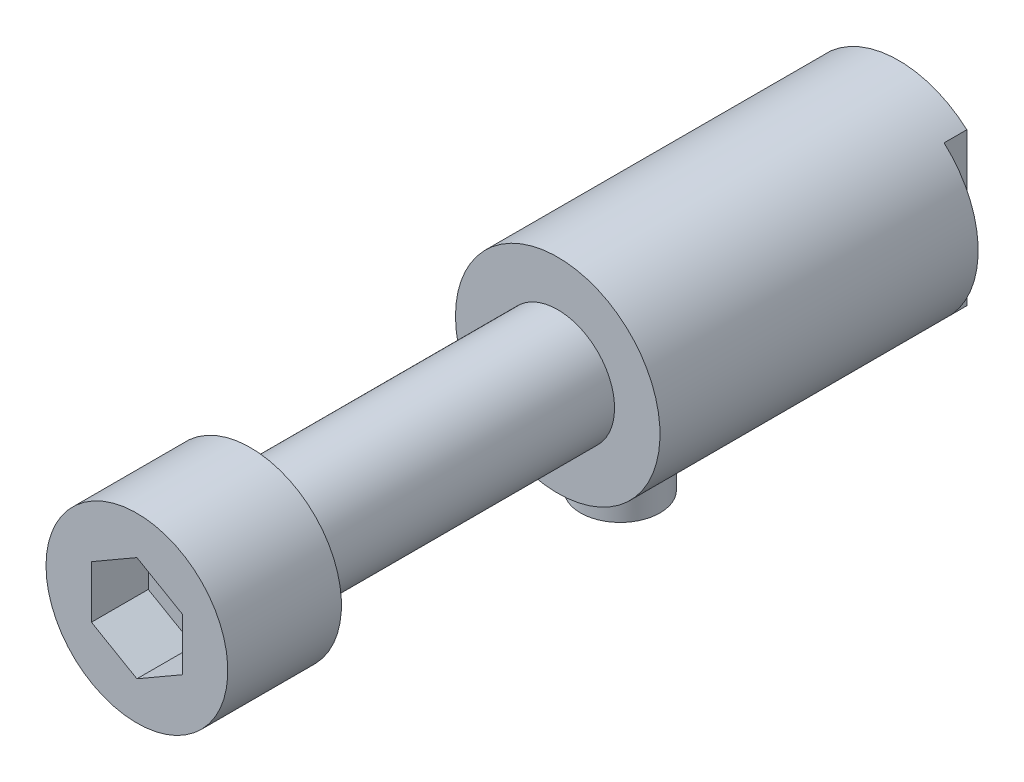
ISO-10303-21;
HEADER;
FILE_DESCRIPTION(('STEP AP214'),'2;1');
FILE_NAME('part.step','',(''),(''),'','','');
FILE_SCHEMA(('AUTOMOTIVE_DESIGN { 1 0 10303 214 1 1 1 1 }'));
ENDSEC;
DATA;
#1=APPLICATION_CONTEXT('core data for automotive mechanical design processes');
#2=APPLICATION_PROTOCOL_DEFINITION('international standard','automotive_design',2000,#1);
#3=PRODUCT_CONTEXT('',#1,'mechanical');
#4=PRODUCT('Part','Part','',(#3));
#5=PRODUCT_RELATED_PRODUCT_CATEGORY('part','',(#4));
#6=PRODUCT_DEFINITION_FORMATION('','',#4);
#7=PRODUCT_DEFINITION_CONTEXT('part definition',#1,'design');
#8=PRODUCT_DEFINITION('design','',#6,#7);
#9=PRODUCT_DEFINITION_SHAPE('','',#8);
#10=(LENGTH_UNIT() NAMED_UNIT(*) SI_UNIT(.MILLI.,.METRE.));
#11=(NAMED_UNIT(*) PLANE_ANGLE_UNIT() SI_UNIT($,.RADIAN.));
#12=(NAMED_UNIT(*) SI_UNIT($,.STERADIAN.) SOLID_ANGLE_UNIT());
#13=UNCERTAINTY_MEASURE_WITH_UNIT(LENGTH_MEASURE(1.E-05),#10,'distance_accuracy_value','');
#14=(GEOMETRIC_REPRESENTATION_CONTEXT(3) GLOBAL_UNCERTAINTY_ASSIGNED_CONTEXT((#13)) GLOBAL_UNIT_ASSIGNED_CONTEXT((#10,
#11,#12)) REPRESENTATION_CONTEXT('',''));
#15=CARTESIAN_POINT('',(0.,0.,0.));
#16=DIRECTION('',(0.,0.,1.));
#17=DIRECTION('',(1.,0.,0.));
#18=AXIS2_PLACEMENT_3D('',#15,#16,#17);
#19=CARTESIAN_POINT('',(0.,0.,0.));
#20=DIRECTION('',(0.,0.,1.));
#21=DIRECTION('',(1.,0.,0.));
#22=AXIS2_PLACEMENT_3D('',#19,#20,#21);
#23=CYLINDRICAL_SURFACE('',#22,9.);
#24=CARTESIAN_POINT('',(0.,-9.,28.));
#25=CARTESIAN_POINT('',(-0.0944966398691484,-9.00000002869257,27.999999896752));
#26=CARTESIAN_POINT('',(-0.188987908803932,-8.9985070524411,27.9961676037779));
#27=CARTESIAN_POINT('',(-0.377269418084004,-8.99258387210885,27.9808914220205));
#28=CARTESIAN_POINT('',(-0.471059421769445,-8.9881527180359,27.9694450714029));
#29=CARTESIAN_POINT('',(-0.750206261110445,-8.97060600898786,27.923833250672));
#30=CARTESIAN_POINT('',(-0.933593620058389,-8.95323676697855,27.8783946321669));
#31=CARTESIAN_POINT('',(-1.2891676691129,-8.90899522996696,27.7593257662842));
#32=CARTESIAN_POINT('',(-1.46137614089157,-8.88214211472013,27.6857523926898));
#33=CARTESIAN_POINT('',(-1.79101147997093,-8.8215855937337,27.5127937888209));
#34=CARTESIAN_POINT('',(-1.94843407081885,-8.78788021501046,27.4134011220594));
#35=CARTESIAN_POINT('',(-2.25110573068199,-8.71537394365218,27.1869491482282));
#36=CARTESIAN_POINT('',(-2.39559841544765,-8.67642148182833,27.0589283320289));
#37=CARTESIAN_POINT('',(-2.66168474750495,-8.59852821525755,26.7808947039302));
#38=CARTESIAN_POINT('',(-2.78327059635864,-8.55958741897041,26.6308744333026));
#39=CARTESIAN_POINT('',(-3.00508028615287,-8.48432701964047,26.3055016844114));
#40=CARTESIAN_POINT('',(-3.10420500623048,-8.44818385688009,26.1293549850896));
#41=CARTESIAN_POINT('',(-3.27108340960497,-8.38498867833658,25.7612673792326));
#42=CARTESIAN_POINT('',(-3.33885070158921,-8.35793272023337,25.5693333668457));
#43=CARTESIAN_POINT('',(-3.43805418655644,-8.31760514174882,25.1838463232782));
#44=CARTESIAN_POINT('',(-3.4709408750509,-8.30378572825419,24.9907258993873));
#45=CARTESIAN_POINT('',(-3.50398302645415,-8.2899009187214,24.6012509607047));
#46=CARTESIAN_POINT('',(-3.50415335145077,-8.28982927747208,24.4048979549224));
#47=CARTESIAN_POINT('',(-3.47286138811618,-8.30297860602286,24.028160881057));
#48=CARTESIAN_POINT('',(-3.44345891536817,-8.31533400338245,23.8475697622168));
#49=CARTESIAN_POINT('',(-3.35727730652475,-8.35049891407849,23.4941218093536));
#50=CARTESIAN_POINT('',(-3.30049372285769,-8.37331012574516,23.3212662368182));
#51=CARTESIAN_POINT('',(-3.16010358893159,-8.42730543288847,22.9841659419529));
#52=CARTESIAN_POINT('',(-3.07598891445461,-8.4586461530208,22.8201590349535));
#53=CARTESIAN_POINT('',(-2.88367974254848,-8.52612200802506,22.5080090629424));
#54=CARTESIAN_POINT('',(-2.77547650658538,-8.56225888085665,22.359871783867));
#55=CARTESIAN_POINT('',(-2.52880675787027,-8.6384578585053,22.0723328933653));
#56=CARTESIAN_POINT('',(-2.38871182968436,-8.67861431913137,21.9343496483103));
#57=CARTESIAN_POINT('',(-2.08692657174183,-8.75608272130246,21.6833960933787));
#58=CARTESIAN_POINT('',(-1.92523241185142,-8.79339415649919,21.5704302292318));
#59=CARTESIAN_POINT('',(-1.58099910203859,-8.86181324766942,21.370993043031));
#60=CARTESIAN_POINT('',(-1.39814089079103,-8.89279902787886,21.2850276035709));
#61=CARTESIAN_POINT('',(-1.01904991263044,-8.94416228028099,21.1455592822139));
#62=CARTESIAN_POINT('',(-0.822823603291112,-8.96454483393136,21.0920408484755));
#63=CARTESIAN_POINT('',(-0.434477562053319,-8.99149370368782,21.0217900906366));
#64=CARTESIAN_POINT('',(-0.242752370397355,-8.99877567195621,21.003149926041));
#65=CARTESIAN_POINT('',(0.141204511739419,-9.00093788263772,20.9975866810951));
#66=CARTESIAN_POINT('',(0.333436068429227,-8.99582112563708,21.0106559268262));
#67=CARTESIAN_POINT('',(0.704484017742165,-8.97423120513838,21.0667156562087));
#68=CARTESIAN_POINT('',(0.883524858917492,-8.95824356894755,21.1084276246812));
#69=CARTESIAN_POINT('',(1.23191930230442,-8.91701575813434,21.2188745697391));
#70=CARTESIAN_POINT('',(1.40127164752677,-8.89177438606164,21.2876130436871));
#71=CARTESIAN_POINT('',(1.73121046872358,-8.83356289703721,21.4523880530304));
#72=CARTESIAN_POINT('',(1.89137927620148,-8.80038288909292,21.5491844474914));
#73=CARTESIAN_POINT('',(2.19375295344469,-8.72992500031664,21.7664778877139));
#74=CARTESIAN_POINT('',(2.33595082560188,-8.69264553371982,21.8869841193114));
#75=CARTESIAN_POINT('',(2.60764760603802,-8.61518244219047,22.1571135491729));
#76=CARTESIAN_POINT('',(2.73579940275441,-8.57496281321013,22.3080848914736));
#77=CARTESIAN_POINT('',(2.96525129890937,-8.49835030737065,22.6301395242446));
#78=CARTESIAN_POINT('',(3.06654794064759,-8.46195792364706,22.8012254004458));
#79=CARTESIAN_POINT('',(3.23979638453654,-8.39716489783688,23.1606793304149));
#80=CARTESIAN_POINT('',(3.31153655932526,-8.36882232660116,23.3491605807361));
#81=CARTESIAN_POINT('',(3.42174179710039,-8.32437875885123,23.7369526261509));
#82=CARTESIAN_POINT('',(3.46022960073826,-8.30826939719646,23.9362559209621));
#83=CARTESIAN_POINT('',(3.50072682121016,-8.29128149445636,24.3253161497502));
#84=CARTESIAN_POINT('',(3.50505568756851,-8.289434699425,24.5147911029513));
#85=CARTESIAN_POINT('',(3.48313623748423,-8.29866867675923,24.8916244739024));
#86=CARTESIAN_POINT('',(3.45689130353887,-8.30974801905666,25.0789831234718));
#87=CARTESIAN_POINT('',(3.3764251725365,-8.34275305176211,25.4395120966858));
#88=CARTESIAN_POINT('',(3.32322482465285,-8.3642818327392,25.6129498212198));
#89=CARTESIAN_POINT('',(3.19128687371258,-8.41550175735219,25.9485218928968));
#90=CARTESIAN_POINT('',(3.11254259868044,-8.44519503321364,26.110653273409));
#91=CARTESIAN_POINT('',(2.92672559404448,-8.51143389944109,26.428744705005));
#92=CARTESIAN_POINT('',(2.8183298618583,-8.54826711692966,26.583871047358));
#93=CARTESIAN_POINT('',(2.5782602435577,-8.62371049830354,26.8744711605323));
#94=CARTESIAN_POINT('',(2.44657868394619,-8.66232124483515,27.0099384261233));
#95=CARTESIAN_POINT('',(2.15429983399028,-8.73974739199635,27.2656700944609));
#96=CARTESIAN_POINT('',(1.99244243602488,-8.778436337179,27.3845365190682));
#97=CARTESIAN_POINT('',(1.64954279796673,-8.84926752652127,27.5934182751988));
#98=CARTESIAN_POINT('',(1.46849654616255,-8.88140839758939,27.6834275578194));
#99=CARTESIAN_POINT('',(1.17940095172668,-8.92297823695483,27.7971011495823));
#100=CARTESIAN_POINT('',(1.07623309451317,-8.93604258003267,27.8322115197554));
#101=CARTESIAN_POINT('',(0.866741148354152,-8.95878491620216,27.8927309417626));
#102=CARTESIAN_POINT('',(0.760418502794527,-8.96846443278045,27.9181443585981));
#103=CARTESIAN_POINT('',(0.545627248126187,-8.9840909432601,27.9589367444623));
#104=CARTESIAN_POINT('',(0.437159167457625,-8.99003884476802,27.9743181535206));
#105=CARTESIAN_POINT('',(0.219124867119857,-8.99799304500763,27.9948490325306));
#106=CARTESIAN_POINT('',(0.109558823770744,-8.99999996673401,28.0000001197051));
#107=CARTESIAN_POINT('',(0.,-9.,28.));
#108=B_SPLINE_CURVE_WITH_KNOTS('',3,(#24,#25,#26,#27,#28,#29,#30,#31,#32,#33,#34,#35,#36,#37,
#38,#39,#40,#41,#42,#43,#44,#45,#46,#47,#48,#49,#50,#51,#52,#53,#54,#55,#56,#57,#58,#59,#60,#61,
#62,#63,#64,#65,#66,#67,#68,#69,#70,#71,#72,#73,#74,#75,#76,#77,#78,#79,#80,#81,#82,#83,#84,#85,
#86,#87,#88,#89,#90,#91,#92,#93,#94,#95,#96,#97,#98,#99,#100,#101,#102,#103,#104,#105,#106,
#107),.UNSPECIFIED.,.T.,.F.,(4,2,2,2,2,2,2,2,2,2,2,2,2,2,2,2,2,2,2,2,2,2,2,2,2,2,2,2,2,2,2,2,2,
2,2,2,2,2,2,2,2,4),(0.,0.283380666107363,0.566853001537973,1.13304671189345,1.69810187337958,
2.26331996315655,2.85154588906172,3.43997171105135,4.05287697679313,4.66551600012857,
5.25153893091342,5.83729564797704,6.38489636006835,6.9325860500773,7.49110419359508,
8.04982528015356,8.64917156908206,9.2486242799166,9.85871753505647,10.468518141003,
11.0438596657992,11.6190619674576,12.1701285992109,12.7212665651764,13.2890048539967,
13.8569635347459,14.4603817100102,15.0638775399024,15.671622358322,16.2789512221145,
16.8446532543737,17.4102927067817,17.9559540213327,18.5017579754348,19.0776683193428,
19.6537688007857,20.2644009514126,20.8751610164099,21.2039909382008,21.532672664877,
21.8612744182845,22.1898242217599),.UNSPECIFIED.);
#109=CARTESIAN_POINT('',(0.,-9.,28.));
#110=VERTEX_POINT('',#109);
#111=EDGE_CURVE('E9',#110,#110,#108,.T.);
#112=ORIENTED_EDGE('',*,*,#111,.F.);
#113=EDGE_LOOP('',(#112));
#114=FACE_BOUND('',#113,.T.);
#115=CARTESIAN_POINT('',(0.,0.,0.));
#116=DIRECTION('',(0.,0.,-1.));
#117=DIRECTION('',(-1.,0.,0.));
#118=AXIS2_PLACEMENT_3D('',#115,#116,#117);
#119=CIRCLE('',#118,9.);
#120=CARTESIAN_POINT('',(6.,-6.70820393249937,0.));
#121=VERTEX_POINT('',#120);
#122=CARTESIAN_POINT('',(-6.,-6.70820393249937,0.));
#123=VERTEX_POINT('',#122);
#124=EDGE_CURVE('E156',#121,#123,#119,.T.);
#125=ORIENTED_EDGE('',*,*,#124,.F.);
#126=DIRECTION('',(0.,0.,-1.));
#127=VECTOR('',#126,1.);
#128=CARTESIAN_POINT('',(6.,-6.70820393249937,2.));
#129=LINE('',#128,#127);
#130=CARTESIAN_POINT('',(6.,-6.70820393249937,2.));
#131=VERTEX_POINT('',#130);
#132=EDGE_CURVE('E137',#131,#121,#129,.T.);
#133=ORIENTED_EDGE('',*,*,#132,.F.);
#134=CARTESIAN_POINT('',(0.,0.,2.));
#135=DIRECTION('',(0.,0.,-1.));
#136=DIRECTION('',(-1.,0.,0.));
#137=AXIS2_PLACEMENT_3D('',#134,#135,#136);
#138=CIRCLE('',#137,9.);
#139=CARTESIAN_POINT('',(6.,6.70820393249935,2.));
#140=VERTEX_POINT('',#139);
#141=EDGE_CURVE('E141',#140,#131,#138,.T.);
#142=ORIENTED_EDGE('',*,*,#141,.F.);
#143=DIRECTION('',(0.,0.,-1.));
#144=VECTOR('',#143,1.);
#145=CARTESIAN_POINT('',(6.,6.70820393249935,2.));
#146=LINE('',#145,#144);
#147=CARTESIAN_POINT('',(6.,6.70820393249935,0.));
#148=VERTEX_POINT('',#147);
#149=EDGE_CURVE('E134',#140,#148,#146,.T.);
#150=ORIENTED_EDGE('',*,*,#149,.T.);
#151=CARTESIAN_POINT('',(-6.,6.70820393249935,0.));
#152=VERTEX_POINT('',#151);
#153=EDGE_CURVE('E149',#152,#148,#119,.T.);
#154=ORIENTED_EDGE('',*,*,#153,.F.);
#155=DIRECTION('',(0.,0.,-1.));
#156=VECTOR('',#155,1.);
#157=CARTESIAN_POINT('',(-6.,6.70820393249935,2.));
#158=LINE('',#157,#156);
#159=CARTESIAN_POINT('',(-6.,6.70820393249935,2.));
#160=VERTEX_POINT('',#159);
#161=EDGE_CURVE('E594',#160,#152,#158,.T.);
#162=ORIENTED_EDGE('',*,*,#161,.F.);
#163=CARTESIAN_POINT('',(0.,0.,2.));
#164=DIRECTION('',(0.,0.,-1.));
#165=DIRECTION('',(-1.,0.,0.));
#166=AXIS2_PLACEMENT_3D('',#163,#164,#165);
#167=CIRCLE('',#166,9.);
#168=CARTESIAN_POINT('',(-6.,-6.70820393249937,2.));
#169=VERTEX_POINT('',#168);
#170=EDGE_CURVE('E601',#169,#160,#167,.T.);
#171=ORIENTED_EDGE('',*,*,#170,.F.);
#172=DIRECTION('',(0.,0.,-1.));
#173=VECTOR('',#172,1.);
#174=CARTESIAN_POINT('',(-6.,-6.70820393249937,2.));
#175=LINE('',#174,#173);
#176=EDGE_CURVE('E592',#169,#123,#175,.T.);
#177=ORIENTED_EDGE('',*,*,#176,.T.);
#178=EDGE_LOOP('',(#125,#133,#142,#150,#154,#162,#171,#177));
#179=FACE_BOUND('',#178,.T.);
#180=CARTESIAN_POINT('',(0.,0.,30.));
#181=DIRECTION('',(0.,0.,-1.));
#182=DIRECTION('',(-1.,0.,0.));
#183=AXIS2_PLACEMENT_3D('',#180,#181,#182);
#184=CIRCLE('',#183,9.);
#185=CARTESIAN_POINT('',(-9.,0.,30.));
#186=VERTEX_POINT('',#185);
#187=EDGE_CURVE('E161',#186,#186,#184,.T.);
#188=ORIENTED_EDGE('',*,*,#187,.T.);
#189=EDGE_LOOP('',(#188));
#190=FACE_BOUND('',#189,.T.);
#191=ADVANCED_FACE('F14',(#114,#179,#190),#23,.T.);
#192=CARTESIAN_POINT('',(0.,0.,0.));
#193=DIRECTION('',(0.,0.,-1.));
#194=DIRECTION('',(-1.,0.,0.));
#195=AXIS2_PLACEMENT_3D('',#192,#193,#194);
#196=PLANE('',#195);
#197=CARTESIAN_POINT('',(0.,0.,0.));
#198=DIRECTION('',(0.,0.,-1.));
#199=DIRECTION('',(-1.,0.,0.));
#200=AXIS2_PLACEMENT_3D('',#197,#198,#199);
#201=CIRCLE('',#200,3.5);
#202=CARTESIAN_POINT('',(-3.5,0.,0.));
#203=VERTEX_POINT('',#202);
#204=EDGE_CURVE('E142',#203,#203,#201,.T.);
#205=ORIENTED_EDGE('',*,*,#204,.F.);
#206=EDGE_LOOP('',(#205));
#207=FACE_BOUND('',#206,.T.);
#208=DIRECTION('',(0.,1.,0.));
#209=VECTOR('',#208,1.);
#210=CARTESIAN_POINT('',(6.,-6.70820393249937,0.));
#211=LINE('',#210,#209);
#212=EDGE_CURVE('E130',#121,#148,#211,.T.);
#213=ORIENTED_EDGE('',*,*,#212,.F.);
#214=ORIENTED_EDGE('',*,*,#124,.T.);
#215=DIRECTION('',(0.,-1.,0.));
#216=VECTOR('',#215,1.);
#217=CARTESIAN_POINT('',(-6.,-6.70820393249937,0.));
#218=LINE('',#217,#216);
#219=EDGE_CURVE('E150',#152,#123,#218,.T.);
#220=ORIENTED_EDGE('',*,*,#219,.F.);
#221=ORIENTED_EDGE('',*,*,#153,.T.);
#222=EDGE_LOOP('',(#213,#214,#220,#221));
#223=FACE_BOUND('',#222,.T.);
#224=ADVANCED_FACE('F153',(#207,#223),#196,.T.);
#225=CARTESIAN_POINT('',(0.,0.,30.));
#226=DIRECTION('',(0.,0.,-1.));
#227=DIRECTION('',(-1.,0.,0.));
#228=AXIS2_PLACEMENT_3D('',#225,#226,#227);
#229=PLANE('',#228);
#230=CARTESIAN_POINT('',(0.,0.,30.));
#231=DIRECTION('',(0.,0.,-1.));
#232=DIRECTION('',(-1.,0.,0.));
#233=AXIS2_PLACEMENT_3D('',#230,#231,#232);
#234=CIRCLE('',#233,5.);
#235=CARTESIAN_POINT('',(-5.,0.,30.));
#236=VERTEX_POINT('',#235);
#237=EDGE_CURVE('E219',#236,#236,#234,.F.);
#238=ORIENTED_EDGE('',*,*,#237,.F.);
#239=EDGE_LOOP('',(#238));
#240=FACE_BOUND('',#239,.T.);
#241=ORIENTED_EDGE('',*,*,#187,.F.);
#242=EDGE_LOOP('',(#241));
#243=FACE_BOUND('',#242,.T.);
#244=ADVANCED_FACE('F284',(#240,#243),#229,.F.);
#245=CARTESIAN_POINT('',(-6.,-6.70820393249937,2.));
#246=DIRECTION('',(1.,0.,0.));
#247=DIRECTION('',(0.,0.,-1.));
#248=AXIS2_PLACEMENT_3D('',#245,#246,#247);
#249=PLANE('',#248);
#250=ORIENTED_EDGE('',*,*,#219,.T.);
#251=ORIENTED_EDGE('',*,*,#176,.F.);
#252=DIRECTION('',(0.,-1.,0.));
#253=VECTOR('',#252,1.);
#254=CARTESIAN_POINT('',(-6.,-6.70820393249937,2.));
#255=LINE('',#254,#253);
#256=EDGE_CURVE('E597',#160,#169,#255,.T.);
#257=ORIENTED_EDGE('',*,*,#256,.F.);
#258=ORIENTED_EDGE('',*,*,#161,.T.);
#259=EDGE_LOOP('',(#250,#251,#257,#258));
#260=FACE_BOUND('',#259,.T.);
#261=ADVANCED_FACE('F372',(#260),#249,.F.);
#262=CARTESIAN_POINT('',(0.,0.,2.));
#263=DIRECTION('',(0.,0.,-1.));
#264=DIRECTION('',(-1.,0.,0.));
#265=AXIS2_PLACEMENT_3D('',#262,#263,#264);
#266=PLANE('',#265);
#267=ORIENTED_EDGE('',*,*,#170,.T.);
#268=ORIENTED_EDGE('',*,*,#256,.T.);
#269=EDGE_LOOP('',(#267,#268));
#270=FACE_BOUND('',#269,.T.);
#271=ADVANCED_FACE('F381',(#270),#266,.T.);
#272=CARTESIAN_POINT('',(6.,-6.70820393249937,2.));
#273=DIRECTION('',(-1.,0.,0.));
#274=DIRECTION('',(0.,0.,1.));
#275=AXIS2_PLACEMENT_3D('',#272,#273,#274);
#276=PLANE('',#275);
#277=ORIENTED_EDGE('',*,*,#212,.T.);
#278=ORIENTED_EDGE('',*,*,#149,.F.);
#279=DIRECTION('',(0.,1.,0.));
#280=VECTOR('',#279,1.);
#281=CARTESIAN_POINT('',(6.,-6.70820393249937,2.));
#282=LINE('',#281,#280);
#283=EDGE_CURVE('E604',#131,#140,#282,.T.);
#284=ORIENTED_EDGE('',*,*,#283,.F.);
#285=ORIENTED_EDGE('',*,*,#132,.T.);
#286=EDGE_LOOP('',(#277,#278,#284,#285));
#287=FACE_BOUND('',#286,.T.);
#288=ADVANCED_FACE('F132',(#287),#276,.F.);
#289=CARTESIAN_POINT('',(0.,0.,2.));
#290=DIRECTION('',(0.,0.,-1.));
#291=DIRECTION('',(-1.,0.,0.));
#292=AXIS2_PLACEMENT_3D('',#289,#290,#291);
#293=PLANE('',#292);
#294=ORIENTED_EDGE('',*,*,#141,.T.);
#295=ORIENTED_EDGE('',*,*,#283,.T.);
#296=EDGE_LOOP('',(#294,#295));
#297=FACE_BOUND('',#296,.T.);
#298=ADVANCED_FACE('F396',(#297),#293,.T.);
#299=CARTESIAN_POINT('',(0.,0.,0.));
#300=DIRECTION('',(0.,0.,-1.));
#301=DIRECTION('',(-1.,0.,0.));
#302=AXIS2_PLACEMENT_3D('',#299,#300,#301);
#303=CONICAL_SURFACE('',#302,3.5,0.523598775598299);
#304=CARTESIAN_POINT('',(0.,0.,0.866025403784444));
#305=DIRECTION('',(0.,0.,-1.));
#306=DIRECTION('',(-1.,0.,0.));
#307=AXIS2_PLACEMENT_3D('',#304,#305,#306);
#308=CIRCLE('',#307,3.);
#309=CARTESIAN_POINT('',(-3.,0.,0.866025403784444));
#310=VERTEX_POINT('',#309);
#311=EDGE_CURVE('E610',#310,#310,#308,.T.);
#312=ORIENTED_EDGE('',*,*,#311,.F.);
#313=EDGE_LOOP('',(#312));
#314=FACE_BOUND('',#313,.T.);
#315=ORIENTED_EDGE('',*,*,#204,.T.);
#316=EDGE_LOOP('',(#315));
#317=FACE_BOUND('',#316,.T.);
#318=ADVANCED_FACE('F362',(#314,#317),#303,.F.);
#319=CARTESIAN_POINT('',(0.,0.,0.));
#320=DIRECTION('',(0.,0.,-1.));
#321=DIRECTION('',(-1.,0.,0.));
#322=AXIS2_PLACEMENT_3D('',#319,#320,#321);
#323=CYLINDRICAL_SURFACE('',#322,3.);
#324=CARTESIAN_POINT('',(0.,0.,10.));
#325=DIRECTION('',(0.,0.,-1.));
#326=DIRECTION('',(-1.,0.,0.));
#327=AXIS2_PLACEMENT_3D('',#324,#325,#326);
#328=CIRCLE('',#327,3.);
#329=CARTESIAN_POINT('',(-3.,0.,10.));
#330=VERTEX_POINT('',#329);
#331=EDGE_CURVE('E613',#330,#330,#328,.T.);
#332=ORIENTED_EDGE('',*,*,#331,.F.);
#333=EDGE_LOOP('',(#332));
#334=FACE_BOUND('',#333,.T.);
#335=ORIENTED_EDGE('',*,*,#311,.T.);
#336=EDGE_LOOP('',(#335));
#337=FACE_BOUND('',#336,.T.);
#338=ADVANCED_FACE('F349',(#334,#337),#323,.F.);
#339=CARTESIAN_POINT('',(4.,-6.92820323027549,62.0354112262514));
#340=DIRECTION('',(0.,0.,-1.));
#341=DIRECTION('',(1.,0.,0.));
#342=AXIS2_PLACEMENT_3D('',#339,#340,#341);
#343=PLANE('',#342);
#344=DIRECTION('',(-0.866025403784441,0.5,0.));
#345=VECTOR('',#344,1.);
#346=CARTESIAN_POINT('',(0.,-4.618802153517,62.0354112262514));
#347=LINE('',#346,#345);
#348=CARTESIAN_POINT('',(0.,-4.618802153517,62.0354112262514));
#349=VERTEX_POINT('',#348);
#350=CARTESIAN_POINT('',(-4.,-2.3094010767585,62.0354112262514));
#351=VERTEX_POINT('',#350);
#352=EDGE_CURVE('E168',#349,#351,#347,.T.);
#353=ORIENTED_EDGE('',*,*,#352,.F.);
#354=DIRECTION('',(0.866025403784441,0.5,0.));
#355=VECTOR('',#354,1.);
#356=CARTESIAN_POINT('',(0.,-4.618802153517,62.0354112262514));
#357=LINE('',#356,#355);
#358=CARTESIAN_POINT('',(4.,-2.3094010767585,62.0354112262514));
#359=VERTEX_POINT('',#358);
#360=EDGE_CURVE('E180',#349,#359,#357,.T.);
#361=ORIENTED_EDGE('',*,*,#360,.T.);
#362=DIRECTION('',(0.,1.,0.));
#363=VECTOR('',#362,1.);
#364=CARTESIAN_POINT('',(4.,-2.3094010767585,62.0354112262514));
#365=LINE('',#364,#363);
#366=CARTESIAN_POINT('',(4.,2.3094010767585,62.0354112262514));
#367=VERTEX_POINT('',#366);
#368=EDGE_CURVE('E184',#359,#367,#365,.T.);
#369=ORIENTED_EDGE('',*,*,#368,.T.);
#370=DIRECTION('',(0.866025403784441,-0.5,0.));
#371=VECTOR('',#370,1.);
#372=CARTESIAN_POINT('',(0.,4.618802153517,62.0354112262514));
#373=LINE('',#372,#371);
#374=CARTESIAN_POINT('',(0.,4.618802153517,62.0354112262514));
#375=VERTEX_POINT('',#374);
#376=EDGE_CURVE('E187',#375,#367,#373,.T.);
#377=ORIENTED_EDGE('',*,*,#376,.F.);
#378=DIRECTION('',(-0.866025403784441,-0.5,0.));
#379=VECTOR('',#378,1.);
#380=CARTESIAN_POINT('',(0.,4.618802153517,62.0354112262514));
#381=LINE('',#380,#379);
#382=CARTESIAN_POINT('',(-4.,2.3094010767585,62.0354112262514));
#383=VERTEX_POINT('',#382);
#384=EDGE_CURVE('E190',#375,#383,#381,.T.);
#385=ORIENTED_EDGE('',*,*,#384,.T.);
#386=DIRECTION('',(0.,-1.,0.));
#387=VECTOR('',#386,1.);
#388=CARTESIAN_POINT('',(-4.,2.3094010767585,62.0354112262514));
#389=LINE('',#388,#387);
#390=EDGE_CURVE('E193',#383,#351,#389,.T.);
#391=ORIENTED_EDGE('',*,*,#390,.T.);
#392=EDGE_LOOP('',(#353,#361,#369,#377,#385,#391));
#393=FACE_BOUND('',#392,.T.);
#394=ADVANCED_FACE('F274',(#393),#343,.F.);
#395=CARTESIAN_POINT('',(4.,-2.3094010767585,62.0354112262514));
#396=DIRECTION('',(1.,0.,0.));
#397=DIRECTION('',(0.,0.,1.));
#398=AXIS2_PLACEMENT_3D('',#395,#396,#397);
#399=PLANE('',#398);
#400=DIRECTION('',(0.,0.,1.));
#401=VECTOR('',#400,1.);
#402=CARTESIAN_POINT('',(4.,-2.3094010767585,62.0354112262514));
#403=LINE('',#402,#401);
#404=CARTESIAN_POINT('',(4.,-2.3094010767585,67.0354112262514));
#405=VERTEX_POINT('',#404);
#406=EDGE_CURVE('E200',#359,#405,#403,.T.);
#407=ORIENTED_EDGE('',*,*,#406,.T.);
#408=DIRECTION('',(0.,1.,0.));
#409=VECTOR('',#408,1.);
#410=CARTESIAN_POINT('',(4.,-2.3094010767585,67.0354112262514));
#411=LINE('',#410,#409);
#412=CARTESIAN_POINT('',(4.,2.3094010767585,67.0354112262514));
#413=VERTEX_POINT('',#412);
#414=EDGE_CURVE('E169',#405,#413,#411,.T.);
#415=ORIENTED_EDGE('',*,*,#414,.T.);
#416=DIRECTION('',(0.,0.,1.));
#417=VECTOR('',#416,1.);
#418=CARTESIAN_POINT('',(4.,2.3094010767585,62.0354112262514));
#419=LINE('',#418,#417);
#420=EDGE_CURVE('E202',#367,#413,#419,.T.);
#421=ORIENTED_EDGE('',*,*,#420,.F.);
#422=ORIENTED_EDGE('',*,*,#368,.F.);
#423=EDGE_LOOP('',(#407,#415,#421,#422));
#424=FACE_BOUND('',#423,.T.);
#425=ADVANCED_FACE('F415',(#424),#399,.F.);
#426=CARTESIAN_POINT('',(0.,4.618802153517,62.0354112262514));
#427=DIRECTION('',(-0.5,-0.86602540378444,0.));
#428=DIRECTION('',(0.866025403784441,-0.5,0.));
#429=AXIS2_PLACEMENT_3D('',#426,#427,#428);
#430=PLANE('',#429);
#431=ORIENTED_EDGE('',*,*,#420,.T.);
#432=DIRECTION('',(0.866025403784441,-0.5,0.));
#433=VECTOR('',#432,1.);
#434=CARTESIAN_POINT('',(0.,4.618802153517,67.0354112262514));
#435=LINE('',#434,#433);
#436=CARTESIAN_POINT('',(0.,4.618802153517,67.0354112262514));
#437=VERTEX_POINT('',#436);
#438=EDGE_CURVE('E172',#437,#413,#435,.T.);
#439=ORIENTED_EDGE('',*,*,#438,.F.);
#440=DIRECTION('',(0.,0.,1.));
#441=VECTOR('',#440,1.);
#442=CARTESIAN_POINT('',(0.,4.618802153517,62.0354112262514));
#443=LINE('',#442,#441);
#444=EDGE_CURVE('E204',#375,#437,#443,.T.);
#445=ORIENTED_EDGE('',*,*,#444,.F.);
#446=ORIENTED_EDGE('',*,*,#376,.T.);
#447=EDGE_LOOP('',(#431,#439,#445,#446));
#448=FACE_BOUND('',#447,.T.);
#449=ADVANCED_FACE('F422',(#448),#430,.T.);
#450=CARTESIAN_POINT('',(0.,4.618802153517,62.0354112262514));
#451=DIRECTION('',(-0.5,0.86602540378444,0.));
#452=DIRECTION('',(-0.866025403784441,-0.5,0.));
#453=AXIS2_PLACEMENT_3D('',#450,#451,#452);
#454=PLANE('',#453);
#455=ORIENTED_EDGE('',*,*,#444,.T.);
#456=DIRECTION('',(-0.866025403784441,-0.5,0.));
#457=VECTOR('',#456,1.);
#458=CARTESIAN_POINT('',(0.,4.618802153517,67.0354112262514));
#459=LINE('',#458,#457);
#460=CARTESIAN_POINT('',(-4.,2.3094010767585,67.0354112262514));
#461=VERTEX_POINT('',#460);
#462=EDGE_CURVE('E175',#437,#461,#459,.T.);
#463=ORIENTED_EDGE('',*,*,#462,.T.);
#464=DIRECTION('',(0.,0.,1.));
#465=VECTOR('',#464,1.);
#466=CARTESIAN_POINT('',(-4.,2.3094010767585,62.0354112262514));
#467=LINE('',#466,#465);
#468=EDGE_CURVE('E206',#383,#461,#467,.T.);
#469=ORIENTED_EDGE('',*,*,#468,.F.);
#470=ORIENTED_EDGE('',*,*,#384,.F.);
#471=EDGE_LOOP('',(#455,#463,#469,#470));
#472=FACE_BOUND('',#471,.T.);
#473=ADVANCED_FACE('F430',(#472),#454,.F.);
#474=CARTESIAN_POINT('',(-4.,2.3094010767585,62.0354112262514));
#475=DIRECTION('',(-1.,0.,0.));
#476=DIRECTION('',(0.,-1.,0.));
#477=AXIS2_PLACEMENT_3D('',#474,#475,#476);
#478=PLANE('',#477);
#479=ORIENTED_EDGE('',*,*,#468,.T.);
#480=DIRECTION('',(0.,-1.,0.));
#481=VECTOR('',#480,1.);
#482=CARTESIAN_POINT('',(-4.,2.3094010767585,67.0354112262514));
#483=LINE('',#482,#481);
#484=CARTESIAN_POINT('',(-4.,-2.3094010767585,67.0354112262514));
#485=VERTEX_POINT('',#484);
#486=EDGE_CURVE('E159',#461,#485,#483,.T.);
#487=ORIENTED_EDGE('',*,*,#486,.T.);
#488=DIRECTION('',(0.,0.,1.));
#489=VECTOR('',#488,1.);
#490=CARTESIAN_POINT('',(-4.,-2.3094010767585,62.0354112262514));
#491=LINE('',#490,#489);
#492=EDGE_CURVE('E208',#351,#485,#491,.T.);
#493=ORIENTED_EDGE('',*,*,#492,.F.);
#494=ORIENTED_EDGE('',*,*,#390,.F.);
#495=EDGE_LOOP('',(#479,#487,#493,#494));
#496=FACE_BOUND('',#495,.T.);
#497=ADVANCED_FACE('F438',(#496),#478,.F.);
#498=CARTESIAN_POINT('',(0.,-4.618802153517,62.0354112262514));
#499=DIRECTION('',(0.5,0.86602540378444,0.));
#500=DIRECTION('',(-0.866025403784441,0.5,0.));
#501=AXIS2_PLACEMENT_3D('',#498,#499,#500);
#502=PLANE('',#501);
#503=ORIENTED_EDGE('',*,*,#492,.T.);
#504=DIRECTION('',(-0.866025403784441,0.5,0.));
#505=VECTOR('',#504,1.);
#506=CARTESIAN_POINT('',(0.,-4.618802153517,67.0354112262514));
#507=LINE('',#506,#505);
#508=CARTESIAN_POINT('',(0.,-4.618802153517,67.0354112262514));
#509=VERTEX_POINT('',#508);
#510=EDGE_CURVE('E155',#509,#485,#507,.T.);
#511=ORIENTED_EDGE('',*,*,#510,.F.);
#512=DIRECTION('',(0.,0.,1.));
#513=VECTOR('',#512,1.);
#514=CARTESIAN_POINT('',(0.,-4.618802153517,62.0354112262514));
#515=LINE('',#514,#513);
#516=EDGE_CURVE('E183',#349,#509,#515,.T.);
#517=ORIENTED_EDGE('',*,*,#516,.F.);
#518=ORIENTED_EDGE('',*,*,#352,.T.);
#519=EDGE_LOOP('',(#503,#511,#517,#518));
#520=FACE_BOUND('',#519,.T.);
#521=ADVANCED_FACE('F446',(#520),#502,.T.);
#522=CARTESIAN_POINT('',(0.,-4.618802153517,62.0354112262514));
#523=DIRECTION('',(0.5,-0.86602540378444,0.));
#524=DIRECTION('',(0.866025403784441,0.5,0.));
#525=AXIS2_PLACEMENT_3D('',#522,#523,#524);
#526=PLANE('',#525);
#527=ORIENTED_EDGE('',*,*,#360,.F.);
#528=ORIENTED_EDGE('',*,*,#516,.T.);
#529=DIRECTION('',(0.866025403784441,0.5,0.));
#530=VECTOR('',#529,1.);
#531=CARTESIAN_POINT('',(0.,-4.618802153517,67.0354112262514));
#532=LINE('',#531,#530);
#533=EDGE_CURVE('E165',#509,#405,#532,.T.);
#534=ORIENTED_EDGE('',*,*,#533,.T.);
#535=ORIENTED_EDGE('',*,*,#406,.F.);
#536=EDGE_LOOP('',(#527,#528,#534,#535));
#537=FACE_BOUND('',#536,.T.);
#538=ADVANCED_FACE('F454',(#537),#526,.F.);
#539=CARTESIAN_POINT('',(0.,0.,67.0354112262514));
#540=DIRECTION('',(0.,0.,1.));
#541=DIRECTION('',(-1.,0.,0.));
#542=AXIS2_PLACEMENT_3D('',#539,#540,#541);
#543=PLANE('',#542);
#544=CARTESIAN_POINT('',(0.,0.,67.0354112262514));
#545=DIRECTION('',(0.,0.,1.));
#546=DIRECTION('',(-1.,0.,0.));
#547=AXIS2_PLACEMENT_3D('',#544,#545,#546);
#548=CIRCLE('',#547,8.);
#549=CARTESIAN_POINT('',(-8.,0.,67.0354112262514));
#550=VERTEX_POINT('',#549);
#551=EDGE_CURVE('E216',#550,#550,#548,.T.);
#552=ORIENTED_EDGE('',*,*,#551,.T.);
#553=EDGE_LOOP('',(#552));
#554=FACE_BOUND('',#553,.T.);
#555=ORIENTED_EDGE('',*,*,#533,.F.);
#556=ORIENTED_EDGE('',*,*,#510,.T.);
#557=ORIENTED_EDGE('',*,*,#486,.F.);
#558=ORIENTED_EDGE('',*,*,#462,.F.);
#559=ORIENTED_EDGE('',*,*,#438,.T.);
#560=ORIENTED_EDGE('',*,*,#414,.F.);
#561=EDGE_LOOP('',(#555,#556,#557,#558,#559,#560));
#562=FACE_BOUND('',#561,.T.);
#563=ADVANCED_FACE('F307',(#554,#562),#543,.T.);
#564=CARTESIAN_POINT('',(0.,0.,47.0354112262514));
#565=DIRECTION('',(0.,0.,1.));
#566=DIRECTION('',(-1.,0.,0.));
#567=AXIS2_PLACEMENT_3D('',#564,#565,#566);
#568=CYLINDRICAL_SURFACE('',#567,8.);
#569=CARTESIAN_POINT('',(0.,0.,57.0354112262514));
#570=DIRECTION('',(0.,0.,1.));
#571=DIRECTION('',(-1.,0.,0.));
#572=AXIS2_PLACEMENT_3D('',#569,#570,#571);
#573=CIRCLE('',#572,8.);
#574=CARTESIAN_POINT('',(-8.,0.,57.0354112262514));
#575=VERTEX_POINT('',#574);
#576=EDGE_CURVE('E213',#575,#575,#573,.T.);
#577=ORIENTED_EDGE('',*,*,#576,.T.);
#578=EDGE_LOOP('',(#577));
#579=FACE_BOUND('',#578,.T.);
#580=ORIENTED_EDGE('',*,*,#551,.F.);
#581=EDGE_LOOP('',(#580));
#582=FACE_BOUND('',#581,.T.);
#583=ADVANCED_FACE('F469',(#579,#582),#568,.T.);
#584=CARTESIAN_POINT('',(-8.,0.,57.0354112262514));
#585=DIRECTION('',(0.,0.,-1.));
#586=DIRECTION('',(1.,0.,0.));
#587=AXIS2_PLACEMENT_3D('',#584,#585,#586);
#588=PLANE('',#587);
#589=CARTESIAN_POINT('',(0.,0.,57.0354112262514));
#590=DIRECTION('',(0.,0.,1.));
#591=DIRECTION('',(-1.,0.,0.));
#592=AXIS2_PLACEMENT_3D('',#589,#590,#591);
#593=CIRCLE('',#592,5.);
#594=CARTESIAN_POINT('',(-5.,0.,57.0354112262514));
#595=VERTEX_POINT('',#594);
#596=EDGE_CURVE('E210',#595,#595,#593,.T.);
#597=ORIENTED_EDGE('',*,*,#596,.T.);
#598=EDGE_LOOP('',(#597));
#599=FACE_BOUND('',#598,.T.);
#600=ORIENTED_EDGE('',*,*,#576,.F.);
#601=EDGE_LOOP('',(#600));
#602=FACE_BOUND('',#601,.T.);
#603=ADVANCED_FACE('F291',(#599,#602),#588,.T.);
#604=CARTESIAN_POINT('',(0.,0.,47.0354112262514));
#605=DIRECTION('',(0.,0.,1.));
#606=DIRECTION('',(-1.,0.,0.));
#607=AXIS2_PLACEMENT_3D('',#604,#605,#606);
#608=CYLINDRICAL_SURFACE('',#607,5.);
#609=ORIENTED_EDGE('',*,*,#596,.F.);
#610=EDGE_LOOP('',(#609));
#611=FACE_BOUND('',#610,.T.);
#612=ORIENTED_EDGE('',*,*,#237,.T.);
#613=EDGE_LOOP('',(#612));
#614=FACE_BOUND('',#613,.T.);
#615=ADVANCED_FACE('F278',(#611,#614),#608,.T.);
#616=CARTESIAN_POINT('',(-0.86602540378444,-9.5,26.));
#617=DIRECTION('',(0.,-1.,0.));
#618=DIRECTION('',(0.,0.,1.));
#619=AXIS2_PLACEMENT_3D('',#616,#617,#618);
#620=PLANE('',#619);
#621=DIRECTION('',(0.5,0.,0.86602540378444));
#622=VECTOR('',#621,1.);
#623=CARTESIAN_POINT('',(-1.73205080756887,-9.5,24.5));
#624=LINE('',#623,#622);
#625=CARTESIAN_POINT('',(-1.73205080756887,-9.5,24.5));
#626=VERTEX_POINT('',#625);
#627=CARTESIAN_POINT('',(-0.86602540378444,-9.5,26.));
#628=VERTEX_POINT('',#627);
#629=EDGE_CURVE('E225',#626,#628,#624,.T.);
#630=ORIENTED_EDGE('',*,*,#629,.F.);
#631=DIRECTION('',(0.5,0.,-0.86602540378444));
#632=VECTOR('',#631,1.);
#633=CARTESIAN_POINT('',(-1.73205080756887,-9.5,24.5));
#634=LINE('',#633,#632);
#635=CARTESIAN_POINT('',(-0.86602540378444,-9.5,23.));
#636=VERTEX_POINT('',#635);
#637=EDGE_CURVE('E239',#626,#636,#634,.T.);
#638=ORIENTED_EDGE('',*,*,#637,.T.);
#639=DIRECTION('',(1.,0.,0.));
#640=VECTOR('',#639,1.);
#641=CARTESIAN_POINT('',(-0.86602540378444,-9.5,23.));
#642=LINE('',#641,#640);
#643=CARTESIAN_POINT('',(0.866025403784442,-9.5,23.));
#644=VERTEX_POINT('',#643);
#645=EDGE_CURVE('E242',#636,#644,#642,.T.);
#646=ORIENTED_EDGE('',*,*,#645,.T.);
#647=DIRECTION('',(-0.5,0.,-0.86602540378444));
#648=VECTOR('',#647,1.);
#649=CARTESIAN_POINT('',(1.73205080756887,-9.5,24.5));
#650=LINE('',#649,#648);
#651=CARTESIAN_POINT('',(1.73205080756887,-9.5,24.5));
#652=VERTEX_POINT('',#651);
#653=EDGE_CURVE('E245',#652,#644,#650,.T.);
#654=ORIENTED_EDGE('',*,*,#653,.F.);
#655=DIRECTION('',(-0.5,0.,0.86602540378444));
#656=VECTOR('',#655,1.);
#657=CARTESIAN_POINT('',(1.73205080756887,-9.5,24.5));
#658=LINE('',#657,#656);
#659=CARTESIAN_POINT('',(0.866025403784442,-9.5,26.));
#660=VERTEX_POINT('',#659);
#661=EDGE_CURVE('E248',#652,#660,#658,.T.);
#662=ORIENTED_EDGE('',*,*,#661,.T.);
#663=DIRECTION('',(-1.,0.,0.));
#664=VECTOR('',#663,1.);
#665=CARTESIAN_POINT('',(0.866025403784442,-9.5,26.));
#666=LINE('',#665,#664);
#667=EDGE_CURVE('E251',#660,#628,#666,.T.);
#668=ORIENTED_EDGE('',*,*,#667,.T.);
#669=EDGE_LOOP('',(#630,#638,#646,#654,#662,#668));
#670=FACE_BOUND('',#669,.T.);
#671=ADVANCED_FACE('F290',(#670),#620,.T.);
#672=CARTESIAN_POINT('',(-0.86602540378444,-9.5,23.));
#673=DIRECTION('',(0.,0.,-1.));
#674=DIRECTION('',(1.,0.,0.));
#675=AXIS2_PLACEMENT_3D('',#672,#673,#674);
#676=PLANE('',#675);
#677=DIRECTION('',(0.,-1.,0.));
#678=VECTOR('',#677,1.);
#679=CARTESIAN_POINT('',(-0.86602540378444,-9.5,23.));
#680=LINE('',#679,#678);
#681=CARTESIAN_POINT('',(-0.86602540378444,-11.5,23.));
#682=VERTEX_POINT('',#681);
#683=EDGE_CURVE('E256',#636,#682,#680,.T.);
#684=ORIENTED_EDGE('',*,*,#683,.T.);
#685=DIRECTION('',(1.,0.,0.));
#686=VECTOR('',#685,1.);
#687=CARTESIAN_POINT('',(-0.86602540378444,-11.5,23.));
#688=LINE('',#687,#686);
#689=CARTESIAN_POINT('',(0.866025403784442,-11.5,23.));
#690=VERTEX_POINT('',#689);
#691=EDGE_CURVE('E226',#682,#690,#688,.T.);
#692=ORIENTED_EDGE('',*,*,#691,.T.);
#693=DIRECTION('',(0.,-1.,0.));
#694=VECTOR('',#693,1.);
#695=CARTESIAN_POINT('',(0.866025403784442,-9.5,23.));
#696=LINE('',#695,#694);
#697=EDGE_CURVE('E258',#644,#690,#696,.T.);
#698=ORIENTED_EDGE('',*,*,#697,.F.);
#699=ORIENTED_EDGE('',*,*,#645,.F.);
#700=EDGE_LOOP('',(#684,#692,#698,#699));
#701=FACE_BOUND('',#700,.T.);
#702=ADVANCED_FACE('F295',(#701),#676,.F.);
#703=CARTESIAN_POINT('',(1.73205080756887,-9.5,24.5));
#704=DIRECTION('',(-0.86602540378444,0.,0.5));
#705=DIRECTION('',(-0.5,0.,-0.86602540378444));
#706=AXIS2_PLACEMENT_3D('',#703,#704,#705);
#707=PLANE('',#706);
#708=ORIENTED_EDGE('',*,*,#697,.T.);
#709=DIRECTION('',(-0.5,0.,-0.86602540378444));
#710=VECTOR('',#709,1.);
#711=CARTESIAN_POINT('',(1.73205080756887,-11.5,24.5));
#712=LINE('',#711,#710);
#713=CARTESIAN_POINT('',(1.73205080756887,-11.5,24.5));
#714=VERTEX_POINT('',#713);
#715=EDGE_CURVE('E229',#714,#690,#712,.T.);
#716=ORIENTED_EDGE('',*,*,#715,.F.);
#717=DIRECTION('',(0.,-1.,0.));
#718=VECTOR('',#717,1.);
#719=CARTESIAN_POINT('',(1.73205080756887,-9.5,24.5));
#720=LINE('',#719,#718);
#721=EDGE_CURVE('E260',#652,#714,#720,.T.);
#722=ORIENTED_EDGE('',*,*,#721,.F.);
#723=ORIENTED_EDGE('',*,*,#653,.T.);
#724=EDGE_LOOP('',(#708,#716,#722,#723));
#725=FACE_BOUND('',#724,.T.);
#726=ADVANCED_FACE('F302',(#725),#707,.T.);
#727=CARTESIAN_POINT('',(1.73205080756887,-9.5,24.5));
#728=DIRECTION('',(0.86602540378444,0.,0.5));
#729=DIRECTION('',(-0.5,0.,0.86602540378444));
#730=AXIS2_PLACEMENT_3D('',#727,#728,#729);
#731=PLANE('',#730);
#732=ORIENTED_EDGE('',*,*,#721,.T.);
#733=DIRECTION('',(-0.5,0.,0.86602540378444));
#734=VECTOR('',#733,1.);
#735=CARTESIAN_POINT('',(1.73205080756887,-11.5,24.5));
#736=LINE('',#735,#734);
#737=CARTESIAN_POINT('',(0.866025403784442,-11.5,26.));
#738=VERTEX_POINT('',#737);
#739=EDGE_CURVE('E232',#714,#738,#736,.T.);
#740=ORIENTED_EDGE('',*,*,#739,.T.);
#741=DIRECTION('',(0.,-1.,0.));
#742=VECTOR('',#741,1.);
#743=CARTESIAN_POINT('',(0.866025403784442,-9.5,26.));
#744=LINE('',#743,#742);
#745=EDGE_CURVE('E262',#660,#738,#744,.T.);
#746=ORIENTED_EDGE('',*,*,#745,.F.);
#747=ORIENTED_EDGE('',*,*,#661,.F.);
#748=EDGE_LOOP('',(#732,#740,#746,#747));
#749=FACE_BOUND('',#748,.T.);
#750=ADVANCED_FACE('F319',(#749),#731,.F.);
#751=CARTESIAN_POINT('',(0.866025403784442,-9.5,26.));
#752=DIRECTION('',(0.,0.,1.));
#753=DIRECTION('',(-1.,0.,0.));
#754=AXIS2_PLACEMENT_3D('',#751,#752,#753);
#755=PLANE('',#754);
#756=ORIENTED_EDGE('',*,*,#745,.T.);
#757=DIRECTION('',(-1.,0.,0.));
#758=VECTOR('',#757,1.);
#759=CARTESIAN_POINT('',(0.866025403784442,-11.5,26.));
#760=LINE('',#759,#758);
#761=CARTESIAN_POINT('',(-0.86602540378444,-11.5,26.));
#762=VERTEX_POINT('',#761);
#763=EDGE_CURVE('E235',#738,#762,#760,.T.);
#764=ORIENTED_EDGE('',*,*,#763,.T.);
#765=DIRECTION('',(0.,-1.,0.));
#766=VECTOR('',#765,1.);
#767=CARTESIAN_POINT('',(-0.86602540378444,-9.5,26.));
#768=LINE('',#767,#766);
#769=EDGE_CURVE('E264',#628,#762,#768,.T.);
#770=ORIENTED_EDGE('',*,*,#769,.F.);
#771=ORIENTED_EDGE('',*,*,#667,.F.);
#772=EDGE_LOOP('',(#756,#764,#770,#771));
#773=FACE_BOUND('',#772,.T.);
#774=ADVANCED_FACE('F313',(#773),#755,.F.);
#775=CARTESIAN_POINT('',(-1.73205080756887,-9.5,24.5));
#776=DIRECTION('',(0.86602540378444,0.,-0.5));
#777=DIRECTION('',(0.5,0.,0.86602540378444));
#778=AXIS2_PLACEMENT_3D('',#775,#776,#777);
#779=PLANE('',#778);
#780=ORIENTED_EDGE('',*,*,#769,.T.);
#781=DIRECTION('',(0.5,0.,0.86602540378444));
#782=VECTOR('',#781,1.);
#783=CARTESIAN_POINT('',(-1.73205080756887,-11.5,24.5));
#784=LINE('',#783,#782);
#785=CARTESIAN_POINT('',(-1.73205080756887,-11.5,24.5));
#786=VERTEX_POINT('',#785);
#787=EDGE_CURVE('E34',#786,#762,#784,.T.);
#788=ORIENTED_EDGE('',*,*,#787,.F.);
#789=DIRECTION('',(0.,-1.,0.));
#790=VECTOR('',#789,1.);
#791=CARTESIAN_POINT('',(-1.73205080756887,-9.5,24.5));
#792=LINE('',#791,#790);
#793=EDGE_CURVE('E38',#626,#786,#792,.T.);
#794=ORIENTED_EDGE('',*,*,#793,.F.);
#795=ORIENTED_EDGE('',*,*,#629,.T.);
#796=EDGE_LOOP('',(#780,#788,#794,#795));
#797=FACE_BOUND('',#796,.T.);
#798=ADVANCED_FACE('F309',(#797),#779,.T.);
#799=CARTESIAN_POINT('',(-1.73205080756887,-9.5,24.5));
#800=DIRECTION('',(-0.86602540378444,0.,-0.5));
#801=DIRECTION('',(0.5,0.,-0.86602540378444));
#802=AXIS2_PLACEMENT_3D('',#799,#800,#801);
#803=PLANE('',#802);
#804=ORIENTED_EDGE('',*,*,#637,.F.);
#805=ORIENTED_EDGE('',*,*,#793,.T.);
#806=DIRECTION('',(0.5,0.,-0.86602540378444));
#807=VECTOR('',#806,1.);
#808=CARTESIAN_POINT('',(-1.73205080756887,-11.5,24.5));
#809=LINE('',#808,#807);
#810=EDGE_CURVE('E222',#786,#682,#809,.T.);
#811=ORIENTED_EDGE('',*,*,#810,.T.);
#812=ORIENTED_EDGE('',*,*,#683,.F.);
#813=EDGE_LOOP('',(#804,#805,#811,#812));
#814=FACE_BOUND('',#813,.T.);
#815=ADVANCED_FACE('F312',(#814),#803,.F.);
#816=CARTESIAN_POINT('',(0.,-11.5,24.5));
#817=DIRECTION('',(0.,-1.,0.));
#818=DIRECTION('',(0.,0.,1.));
#819=AXIS2_PLACEMENT_3D('',#816,#817,#818);
#820=PLANE('',#819);
#821=CARTESIAN_POINT('',(0.,-11.5,24.5));
#822=DIRECTION('',(0.,-1.,0.));
#823=DIRECTION('',(0.,0.,1.));
#824=AXIS2_PLACEMENT_3D('',#821,#822,#823);
#825=CIRCLE('',#824,3.5);
#826=CARTESIAN_POINT('',(0.,-11.5,28.));
#827=VERTEX_POINT('',#826);
#828=EDGE_CURVE('E27',#827,#827,#825,.T.);
#829=ORIENTED_EDGE('',*,*,#828,.T.);
#830=EDGE_LOOP('',(#829));
#831=FACE_BOUND('',#830,.T.);
#832=ORIENTED_EDGE('',*,*,#810,.F.);
#833=ORIENTED_EDGE('',*,*,#787,.T.);
#834=ORIENTED_EDGE('',*,*,#763,.F.);
#835=ORIENTED_EDGE('',*,*,#739,.F.);
#836=ORIENTED_EDGE('',*,*,#715,.T.);
#837=ORIENTED_EDGE('',*,*,#691,.F.);
#838=EDGE_LOOP('',(#832,#833,#834,#835,#836,#837));
#839=FACE_BOUND('',#838,.T.);
#840=ADVANCED_FACE('F268',(#831,#839),#820,.T.);
#841=CARTESIAN_POINT('',(0.,-21.5,24.5));
#842=DIRECTION('',(0.,-1.,0.));
#843=DIRECTION('',(0.,0.,1.));
#844=AXIS2_PLACEMENT_3D('',#841,#842,#843);
#845=CYLINDRICAL_SURFACE('',#844,3.5);
#846=ORIENTED_EDGE('',*,*,#828,.F.);
#847=EDGE_LOOP('',(#846));
#848=FACE_BOUND('',#847,.T.);
#849=ORIENTED_EDGE('',*,*,#111,.T.);
#850=EDGE_LOOP('',(#849));
#851=FACE_BOUND('',#850,.T.);
#852=ADVANCED_FACE('F16',(#848,#851),#845,.T.);
#853=CARTESIAN_POINT('',(0.,0.,10.));
#854=DIRECTION('',(0.,0.,-1.));
#855=DIRECTION('',(-1.,0.,0.));
#856=AXIS2_PLACEMENT_3D('',#853,#854,#855);
#857=PLANE('',#856);
#858=ORIENTED_EDGE('',*,*,#331,.T.);
#859=EDGE_LOOP('',(#858));
#860=FACE_BOUND('',#859,.T.);
#861=ADVANCED_FACE('F273',(#860),#857,.T.);
#862=CLOSED_SHELL('',(#191,#224,#244,#261,#271,#288,#298,#318,#338,#394,#425,#449,#473,#497,
#521,#538,#563,#583,#603,#615,#671,#702,#726,#750,#774,#798,#815,#840,#852,#861));
#863=MANIFOLD_SOLID_BREP('B1',#862);
#864=ADVANCED_BREP_SHAPE_REPRESENTATION('',(#18,#863),#14);
#865=SHAPE_DEFINITION_REPRESENTATION(#9,#864);
ENDSEC;
END-ISO-10303-21;
